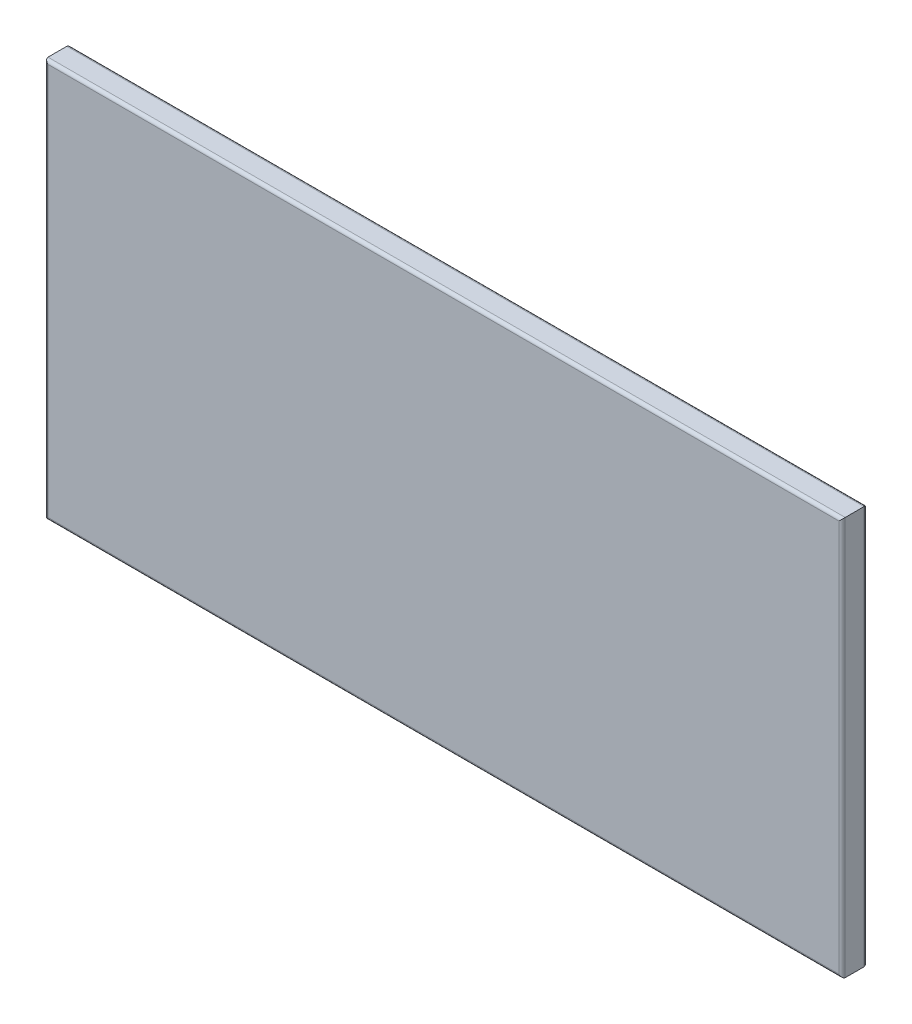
ISO-10303-21;
HEADER;
FILE_DESCRIPTION(('STEP AP214'),'2;1');
FILE_NAME('part.step','',(''),(''),'','','');
FILE_SCHEMA(('AUTOMOTIVE_DESIGN { 1 0 10303 214 1 1 1 1 }'));
ENDSEC;
DATA;
#1=APPLICATION_CONTEXT('core data for automotive mechanical design processes');
#2=APPLICATION_PROTOCOL_DEFINITION('international standard','automotive_design',2000,#1);
#3=PRODUCT_CONTEXT('',#1,'mechanical');
#4=PRODUCT('Part','Part','',(#3));
#5=PRODUCT_RELATED_PRODUCT_CATEGORY('part','',(#4));
#6=PRODUCT_DEFINITION_FORMATION('','',#4);
#7=PRODUCT_DEFINITION_CONTEXT('part definition',#1,'design');
#8=PRODUCT_DEFINITION('design','',#6,#7);
#9=PRODUCT_DEFINITION_SHAPE('','',#8);
#10=(LENGTH_UNIT() NAMED_UNIT(*) SI_UNIT(.MILLI.,.METRE.));
#11=(NAMED_UNIT(*) PLANE_ANGLE_UNIT() SI_UNIT($,.RADIAN.));
#12=(NAMED_UNIT(*) SI_UNIT($,.STERADIAN.) SOLID_ANGLE_UNIT());
#13=UNCERTAINTY_MEASURE_WITH_UNIT(LENGTH_MEASURE(1.E-05),#10,'distance_accuracy_value','');
#14=(GEOMETRIC_REPRESENTATION_CONTEXT(3) GLOBAL_UNCERTAINTY_ASSIGNED_CONTEXT((#13)) GLOBAL_UNIT_ASSIGNED_CONTEXT((#10,
#11,#12)) REPRESENTATION_CONTEXT('',''));
#15=CARTESIAN_POINT('',(0.,0.,0.));
#16=DIRECTION('',(0.,0.,1.));
#17=DIRECTION('',(1.,0.,0.));
#18=AXIS2_PLACEMENT_3D('',#15,#16,#17);
#19=CARTESIAN_POINT('',(31.8,-15.9,2.));
#20=DIRECTION('',(-1.,0.,0.));
#21=DIRECTION('',(0.,0.,1.));
#22=AXIS2_PLACEMENT_3D('',#19,#20,#21);
#23=PLANE('',#22);
#24=DIRECTION('',(0.,0.,-1.));
#25=VECTOR('',#24,1.);
#26=CARTESIAN_POINT('',(31.8,-15.9,2.));
#27=LINE('',#26,#25);
#28=CARTESIAN_POINT('',(31.8,-15.9,1.75));
#29=VERTEX_POINT('',#28);
#30=CARTESIAN_POINT('',(31.8,-15.9,0.25));
#31=VERTEX_POINT('',#30);
#32=EDGE_CURVE('E158',#29,#31,#27,.T.);
#33=ORIENTED_EDGE('',*,*,#32,.T.);
#34=DIRECTION('',(0.,1.,0.));
#35=VECTOR('',#34,1.);
#36=CARTESIAN_POINT('',(31.8,15.9,0.25));
#37=LINE('',#36,#35);
#38=CARTESIAN_POINT('',(31.8,15.9,0.25));
#39=VERTEX_POINT('',#38);
#40=EDGE_CURVE('E172',#31,#39,#37,.T.);
#41=ORIENTED_EDGE('',*,*,#40,.T.);
#42=DIRECTION('',(0.,0.,-1.));
#43=VECTOR('',#42,1.);
#44=CARTESIAN_POINT('',(31.8,15.9,2.));
#45=LINE('',#44,#43);
#46=CARTESIAN_POINT('',(31.8,15.9,1.75));
#47=VERTEX_POINT('',#46);
#48=EDGE_CURVE('E129',#47,#39,#45,.T.);
#49=ORIENTED_EDGE('',*,*,#48,.F.);
#50=DIRECTION('',(0.,1.,0.));
#51=VECTOR('',#50,1.);
#52=CARTESIAN_POINT('',(31.8,-15.9,1.75));
#53=LINE('',#52,#51);
#54=EDGE_CURVE('E175',#47,#29,#53,.F.);
#55=ORIENTED_EDGE('',*,*,#54,.T.);
#56=EDGE_LOOP('',(#33,#41,#49,#55));
#57=FACE_BOUND('',#56,.T.);
#58=ADVANCED_FACE('F39',(#57),#23,.F.);
#59=CARTESIAN_POINT('',(-31.8,15.9,2.));
#60=DIRECTION('',(0.,-1.,0.));
#61=DIRECTION('',(0.,0.,-1.));
#62=AXIS2_PLACEMENT_3D('',#59,#60,#61);
#63=PLANE('',#62);
#64=ORIENTED_EDGE('',*,*,#48,.T.);
#65=DIRECTION('',(-1.,0.,0.));
#66=VECTOR('',#65,1.);
#67=CARTESIAN_POINT('',(-31.8,15.9,0.25));
#68=LINE('',#67,#66);
#69=CARTESIAN_POINT('',(-31.8,15.9,0.25));
#70=VERTEX_POINT('',#69);
#71=EDGE_CURVE('E127',#39,#70,#68,.T.);
#72=ORIENTED_EDGE('',*,*,#71,.T.);
#73=DIRECTION('',(0.,0.,-1.));
#74=VECTOR('',#73,1.);
#75=CARTESIAN_POINT('',(-31.8,15.9,2.));
#76=LINE('',#75,#74);
#77=CARTESIAN_POINT('',(-31.8,15.9,1.75));
#78=VERTEX_POINT('',#77);
#79=EDGE_CURVE('E109',#78,#70,#76,.T.);
#80=ORIENTED_EDGE('',*,*,#79,.F.);
#81=DIRECTION('',(-1.,0.,0.));
#82=VECTOR('',#81,1.);
#83=CARTESIAN_POINT('',(-31.8,15.9,1.75));
#84=LINE('',#83,#82);
#85=EDGE_CURVE('E124',#78,#47,#84,.F.);
#86=ORIENTED_EDGE('',*,*,#85,.T.);
#87=EDGE_LOOP('',(#64,#72,#80,#86));
#88=FACE_BOUND('',#87,.T.);
#89=ADVANCED_FACE('F123',(#88),#63,.F.);
#90=CARTESIAN_POINT('',(-31.8,-15.9,2.));
#91=DIRECTION('',(1.,0.,0.));
#92=DIRECTION('',(0.,0.,-1.));
#93=AXIS2_PLACEMENT_3D('',#90,#91,#92);
#94=PLANE('',#93);
#95=ORIENTED_EDGE('',*,*,#79,.T.);
#96=DIRECTION('',(0.,-1.,0.));
#97=VECTOR('',#96,1.);
#98=CARTESIAN_POINT('',(-31.8,-15.9,0.25));
#99=LINE('',#98,#97);
#100=CARTESIAN_POINT('',(-31.8,-15.9,0.25));
#101=VERTEX_POINT('',#100);
#102=EDGE_CURVE('E116',#70,#101,#99,.T.);
#103=ORIENTED_EDGE('',*,*,#102,.T.);
#104=DIRECTION('',(0.,0.,-1.));
#105=VECTOR('',#104,1.);
#106=CARTESIAN_POINT('',(-31.8,-15.9,2.));
#107=LINE('',#106,#105);
#108=CARTESIAN_POINT('',(-31.8,-15.9,1.75));
#109=VERTEX_POINT('',#108);
#110=EDGE_CURVE('E111',#109,#101,#107,.T.);
#111=ORIENTED_EDGE('',*,*,#110,.F.);
#112=DIRECTION('',(0.,-1.,0.));
#113=VECTOR('',#112,1.);
#114=CARTESIAN_POINT('',(-31.8,-15.9,1.75));
#115=LINE('',#114,#113);
#116=EDGE_CURVE('E106',#109,#78,#115,.F.);
#117=ORIENTED_EDGE('',*,*,#116,.T.);
#118=EDGE_LOOP('',(#95,#103,#111,#117));
#119=FACE_BOUND('',#118,.T.);
#120=ADVANCED_FACE('F108',(#119),#94,.F.);
#121=CARTESIAN_POINT('',(-31.8,-15.9,2.));
#122=DIRECTION('',(0.,1.,0.));
#123=DIRECTION('',(0.,0.,1.));
#124=AXIS2_PLACEMENT_3D('',#121,#122,#123);
#125=PLANE('',#124);
#126=ORIENTED_EDGE('',*,*,#110,.T.);
#127=DIRECTION('',(1.,0.,0.));
#128=VECTOR('',#127,1.);
#129=CARTESIAN_POINT('',(31.8,-15.9,0.25));
#130=LINE('',#129,#128);
#131=EDGE_CURVE('E178',#101,#31,#130,.T.);
#132=ORIENTED_EDGE('',*,*,#131,.T.);
#133=ORIENTED_EDGE('',*,*,#32,.F.);
#134=DIRECTION('',(1.,0.,0.));
#135=VECTOR('',#134,1.);
#136=CARTESIAN_POINT('',(-31.8,-15.9,1.75));
#137=LINE('',#136,#135);
#138=EDGE_CURVE('E181',#29,#109,#137,.F.);
#139=ORIENTED_EDGE('',*,*,#138,.T.);
#140=EDGE_LOOP('',(#126,#132,#133,#139));
#141=FACE_BOUND('',#140,.T.);
#142=ADVANCED_FACE('F229',(#141),#125,.F.);
#143=CARTESIAN_POINT('',(0.,0.,2.));
#144=DIRECTION('',(0.,0.,-1.));
#145=DIRECTION('',(-1.,0.,0.));
#146=AXIS2_PLACEMENT_3D('',#143,#144,#145);
#147=PLANE('',#146);
#148=DIRECTION('',(0.,-1.,0.));
#149=VECTOR('',#148,1.);
#150=CARTESIAN_POINT('',(-31.55,0.,2.));
#151=LINE('',#150,#149);
#152=CARTESIAN_POINT('',(-31.55,15.65,2.));
#153=VERTEX_POINT('',#152);
#154=CARTESIAN_POINT('',(-31.55,-15.65,2.));
#155=VERTEX_POINT('',#154);
#156=EDGE_CURVE('E49',#153,#155,#151,.T.);
#157=ORIENTED_EDGE('',*,*,#156,.T.);
#158=DIRECTION('',(1.,0.,0.));
#159=VECTOR('',#158,1.);
#160=CARTESIAN_POINT('',(0.,-15.65,2.));
#161=LINE('',#160,#159);
#162=CARTESIAN_POINT('',(31.55,-15.65,2.));
#163=VERTEX_POINT('',#162);
#164=EDGE_CURVE('E11',#155,#163,#161,.T.);
#165=ORIENTED_EDGE('',*,*,#164,.T.);
#166=DIRECTION('',(0.,1.,0.));
#167=VECTOR('',#166,1.);
#168=CARTESIAN_POINT('',(31.55,0.,2.));
#169=LINE('',#168,#167);
#170=CARTESIAN_POINT('',(31.55,15.65,2.));
#171=VERTEX_POINT('',#170);
#172=EDGE_CURVE('E169',#163,#171,#169,.T.);
#173=ORIENTED_EDGE('',*,*,#172,.T.);
#174=DIRECTION('',(-1.,0.,0.));
#175=VECTOR('',#174,1.);
#176=CARTESIAN_POINT('',(0.,15.65,2.));
#177=LINE('',#176,#175);
#178=EDGE_CURVE('E60',#171,#153,#177,.T.);
#179=ORIENTED_EDGE('',*,*,#178,.T.);
#180=EDGE_LOOP('',(#157,#165,#173,#179));
#181=FACE_BOUND('',#180,.T.);
#182=ADVANCED_FACE('F235',(#181),#147,.F.);
#183=CARTESIAN_POINT('',(0.,0.,0.));
#184=DIRECTION('',(0.,0.,-1.));
#185=DIRECTION('',(-1.,0.,0.));
#186=AXIS2_PLACEMENT_3D('',#183,#184,#185);
#187=PLANE('',#186);
#188=DIRECTION('',(0.,-1.,0.));
#189=VECTOR('',#188,1.);
#190=CARTESIAN_POINT('',(-31.55,15.9,0.));
#191=LINE('',#190,#189);
#192=CARTESIAN_POINT('',(-31.55,-15.65,0.));
#193=VERTEX_POINT('',#192);
#194=CARTESIAN_POINT('',(-31.55,15.65,0.));
#195=VERTEX_POINT('',#194);
#196=EDGE_CURVE('E189',#193,#195,#191,.F.);
#197=ORIENTED_EDGE('',*,*,#196,.T.);
#198=DIRECTION('',(-1.,0.,0.));
#199=VECTOR('',#198,1.);
#200=CARTESIAN_POINT('',(31.8,15.65,0.));
#201=LINE('',#200,#199);
#202=CARTESIAN_POINT('',(31.55,15.65,0.));
#203=VERTEX_POINT('',#202);
#204=EDGE_CURVE('E117',#195,#203,#201,.F.);
#205=ORIENTED_EDGE('',*,*,#204,.T.);
#206=DIRECTION('',(0.,1.,0.));
#207=VECTOR('',#206,1.);
#208=CARTESIAN_POINT('',(31.55,-15.9,0.));
#209=LINE('',#208,#207);
#210=CARTESIAN_POINT('',(31.55,-15.65,0.));
#211=VERTEX_POINT('',#210);
#212=EDGE_CURVE('E195',#203,#211,#209,.F.);
#213=ORIENTED_EDGE('',*,*,#212,.T.);
#214=DIRECTION('',(1.,0.,0.));
#215=VECTOR('',#214,1.);
#216=CARTESIAN_POINT('',(-31.8,-15.65,0.));
#217=LINE('',#216,#215);
#218=EDGE_CURVE('E192',#211,#193,#217,.F.);
#219=ORIENTED_EDGE('',*,*,#218,.T.);
#220=EDGE_LOOP('',(#197,#205,#213,#219));
#221=FACE_BOUND('',#220,.T.);
#222=ADVANCED_FACE('F237',(#221),#187,.T.);
#223=CARTESIAN_POINT('',(-31.8,-15.65,0.25));
#224=DIRECTION('',(-1.,0.,0.));
#225=DIRECTION('',(0.,0.,1.));
#226=AXIS2_PLACEMENT_3D('',#223,#224,#225);
#227=CYLINDRICAL_SURFACE('',#226,0.25);
#228=CARTESIAN_POINT('',(-31.55,-15.65,0.25));
#229=DIRECTION('',(-0.707106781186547,0.707106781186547,0.));
#230=DIRECTION('',(-0.707106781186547,-0.707106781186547,0.));
#231=AXIS2_PLACEMENT_3D('',#228,#229,#230);
#232=ELLIPSE('',#231,0.353553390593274,0.25);
#233=EDGE_CURVE('E159',#193,#101,#232,.T.);
#234=ORIENTED_EDGE('',*,*,#233,.F.);
#235=ORIENTED_EDGE('',*,*,#218,.F.);
#236=CARTESIAN_POINT('',(31.55,-15.65,0.25));
#237=DIRECTION('',(-0.707106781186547,-0.707106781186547,0.));
#238=DIRECTION('',(0.707106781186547,-0.707106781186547,0.));
#239=AXIS2_PLACEMENT_3D('',#236,#237,#238);
#240=ELLIPSE('',#239,0.353553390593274,0.25);
#241=EDGE_CURVE('E154',#31,#211,#240,.F.);
#242=ORIENTED_EDGE('',*,*,#241,.F.);
#243=ORIENTED_EDGE('',*,*,#131,.F.);
#244=EDGE_LOOP('',(#234,#235,#242,#243));
#245=FACE_BOUND('',#244,.T.);
#246=ADVANCED_FACE('F216',(#245),#227,.T.);
#247=CARTESIAN_POINT('',(31.55,-15.9,0.25));
#248=DIRECTION('',(0.,-1.,0.));
#249=DIRECTION('',(0.,0.,-1.));
#250=AXIS2_PLACEMENT_3D('',#247,#248,#249);
#251=CYLINDRICAL_SURFACE('',#250,0.25);
#252=ORIENTED_EDGE('',*,*,#241,.T.);
#253=ORIENTED_EDGE('',*,*,#212,.F.);
#254=CARTESIAN_POINT('',(31.55,15.65,0.25));
#255=DIRECTION('',(0.707106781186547,-0.707106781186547,0.));
#256=DIRECTION('',(-0.707106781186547,-0.707106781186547,0.));
#257=AXIS2_PLACEMENT_3D('',#254,#255,#256);
#258=ELLIPSE('',#257,0.353553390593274,0.25);
#259=EDGE_CURVE('E143',#39,#203,#258,.F.);
#260=ORIENTED_EDGE('',*,*,#259,.F.);
#261=ORIENTED_EDGE('',*,*,#40,.F.);
#262=EDGE_LOOP('',(#252,#253,#260,#261));
#263=FACE_BOUND('',#262,.T.);
#264=ADVANCED_FACE('F220',(#263),#251,.T.);
#265=CARTESIAN_POINT('',(-31.55,-15.9,0.25));
#266=DIRECTION('',(0.,1.,0.));
#267=DIRECTION('',(0.,0.,1.));
#268=AXIS2_PLACEMENT_3D('',#265,#266,#267);
#269=CYLINDRICAL_SURFACE('',#268,0.25);
#270=ORIENTED_EDGE('',*,*,#233,.T.);
#271=ORIENTED_EDGE('',*,*,#102,.F.);
#272=CARTESIAN_POINT('',(-31.55,15.65,0.25));
#273=DIRECTION('',(0.707106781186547,0.707106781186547,0.));
#274=DIRECTION('',(-0.707106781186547,0.707106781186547,0.));
#275=AXIS2_PLACEMENT_3D('',#272,#273,#274);
#276=ELLIPSE('',#275,0.353553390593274,0.25);
#277=EDGE_CURVE('E140',#195,#70,#276,.T.);
#278=ORIENTED_EDGE('',*,*,#277,.F.);
#279=ORIENTED_EDGE('',*,*,#196,.F.);
#280=EDGE_LOOP('',(#270,#271,#278,#279));
#281=FACE_BOUND('',#280,.T.);
#282=ADVANCED_FACE('F228',(#281),#269,.T.);
#283=CARTESIAN_POINT('',(-31.8,15.65,0.25));
#284=DIRECTION('',(1.,0.,0.));
#285=DIRECTION('',(0.,0.,-1.));
#286=AXIS2_PLACEMENT_3D('',#283,#284,#285);
#287=CYLINDRICAL_SURFACE('',#286,0.25);
#288=ORIENTED_EDGE('',*,*,#259,.T.);
#289=ORIENTED_EDGE('',*,*,#204,.F.);
#290=ORIENTED_EDGE('',*,*,#277,.T.);
#291=ORIENTED_EDGE('',*,*,#71,.F.);
#292=EDGE_LOOP('',(#288,#289,#290,#291));
#293=FACE_BOUND('',#292,.T.);
#294=ADVANCED_FACE('F223',(#293),#287,.T.);
#295=CARTESIAN_POINT('',(0.,15.65,1.75));
#296=DIRECTION('',(-1.,0.,0.));
#297=DIRECTION('',(0.,0.,1.));
#298=AXIS2_PLACEMENT_3D('',#295,#296,#297);
#299=CYLINDRICAL_SURFACE('',#298,0.25);
#300=CARTESIAN_POINT('',(31.55,15.65,1.75));
#301=DIRECTION('',(-0.707106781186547,0.707106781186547,0.));
#302=DIRECTION('',(0.707106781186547,0.707106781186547,0.));
#303=AXIS2_PLACEMENT_3D('',#300,#301,#302);
#304=ELLIPSE('',#303,0.353553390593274,0.25);
#305=EDGE_CURVE('E134',#47,#171,#304,.F.);
#306=ORIENTED_EDGE('',*,*,#305,.F.);
#307=ORIENTED_EDGE('',*,*,#85,.F.);
#308=CARTESIAN_POINT('',(-31.55,15.65,1.75));
#309=DIRECTION('',(-0.707106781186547,-0.707106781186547,0.));
#310=DIRECTION('',(-0.707106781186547,0.707106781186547,0.));
#311=AXIS2_PLACEMENT_3D('',#308,#309,#310);
#312=ELLIPSE('',#311,0.353553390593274,0.25);
#313=EDGE_CURVE('E43',#153,#78,#312,.T.);
#314=ORIENTED_EDGE('',*,*,#313,.F.);
#315=ORIENTED_EDGE('',*,*,#178,.F.);
#316=EDGE_LOOP('',(#306,#307,#314,#315));
#317=FACE_BOUND('',#316,.T.);
#318=ADVANCED_FACE('F41',(#317),#299,.T.);
#319=CARTESIAN_POINT('',(-31.55,0.,1.75));
#320=DIRECTION('',(0.,-1.,0.));
#321=DIRECTION('',(0.,0.,-1.));
#322=AXIS2_PLACEMENT_3D('',#319,#320,#321);
#323=CYLINDRICAL_SURFACE('',#322,0.25);
#324=ORIENTED_EDGE('',*,*,#313,.T.);
#325=ORIENTED_EDGE('',*,*,#116,.F.);
#326=CARTESIAN_POINT('',(-31.55,-15.65,1.75));
#327=DIRECTION('',(0.707106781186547,-0.707106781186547,0.));
#328=DIRECTION('',(-0.707106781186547,-0.707106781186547,0.));
#329=AXIS2_PLACEMENT_3D('',#326,#327,#328);
#330=ELLIPSE('',#329,0.353553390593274,0.25);
#331=EDGE_CURVE('E145',#155,#109,#330,.T.);
#332=ORIENTED_EDGE('',*,*,#331,.F.);
#333=ORIENTED_EDGE('',*,*,#156,.F.);
#334=EDGE_LOOP('',(#324,#325,#332,#333));
#335=FACE_BOUND('',#334,.T.);
#336=ADVANCED_FACE('F138',(#335),#323,.T.);
#337=CARTESIAN_POINT('',(31.55,0.,1.75));
#338=DIRECTION('',(0.,1.,0.));
#339=DIRECTION('',(0.,0.,1.));
#340=AXIS2_PLACEMENT_3D('',#337,#338,#339);
#341=CYLINDRICAL_SURFACE('',#340,0.25);
#342=ORIENTED_EDGE('',*,*,#305,.T.);
#343=ORIENTED_EDGE('',*,*,#172,.F.);
#344=CARTESIAN_POINT('',(31.55,-15.65,1.75));
#345=DIRECTION('',(0.707106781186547,0.707106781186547,0.));
#346=DIRECTION('',(-0.707106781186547,0.707106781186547,0.));
#347=AXIS2_PLACEMENT_3D('',#344,#345,#346);
#348=ELLIPSE('',#347,0.353553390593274,0.25);
#349=EDGE_CURVE('E149',#29,#163,#348,.F.);
#350=ORIENTED_EDGE('',*,*,#349,.F.);
#351=ORIENTED_EDGE('',*,*,#54,.F.);
#352=EDGE_LOOP('',(#342,#343,#350,#351));
#353=FACE_BOUND('',#352,.T.);
#354=ADVANCED_FACE('F234',(#353),#341,.T.);
#355=CARTESIAN_POINT('',(0.,-15.65,1.75));
#356=DIRECTION('',(1.,0.,0.));
#357=DIRECTION('',(0.,0.,-1.));
#358=AXIS2_PLACEMENT_3D('',#355,#356,#357);
#359=CYLINDRICAL_SURFACE('',#358,0.25);
#360=ORIENTED_EDGE('',*,*,#331,.T.);
#361=ORIENTED_EDGE('',*,*,#138,.F.);
#362=ORIENTED_EDGE('',*,*,#349,.T.);
#363=ORIENTED_EDGE('',*,*,#164,.F.);
#364=EDGE_LOOP('',(#360,#361,#362,#363));
#365=FACE_BOUND('',#364,.T.);
#366=ADVANCED_FACE('F232',(#365),#359,.T.);
#367=CLOSED_SHELL('',(#58,#89,#120,#142,#182,#222,#246,#264,#282,#294,#318,#336,#354,#366));
#368=MANIFOLD_SOLID_BREP('B2',#367);
#369=ADVANCED_BREP_SHAPE_REPRESENTATION('',(#18,#368),#14);
#370=SHAPE_DEFINITION_REPRESENTATION(#9,#369);
ENDSEC;
END-ISO-10303-21;
